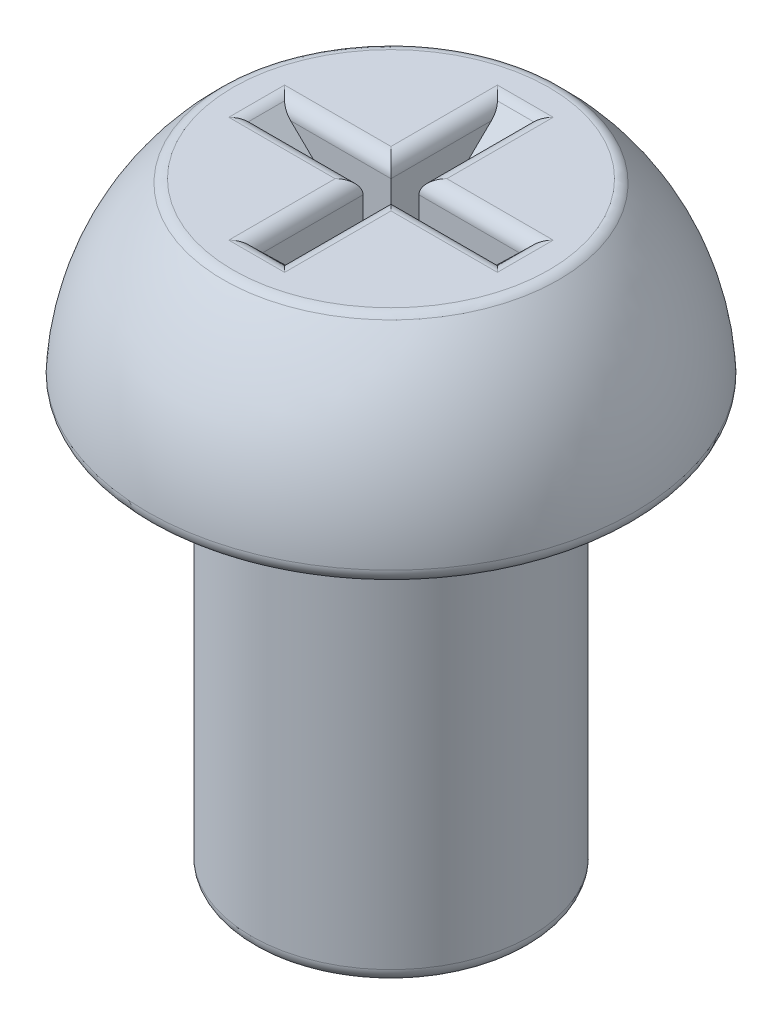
ISO-10303-21;
HEADER;
FILE_DESCRIPTION(('STEP AP214'),'2;1');
FILE_NAME('part.step','',(''),(''),'','','');
FILE_SCHEMA(('AUTOMOTIVE_DESIGN { 1 0 10303 214 1 1 1 1 }'));
ENDSEC;
DATA;
#1=APPLICATION_CONTEXT('core data for automotive mechanical design processes');
#2=APPLICATION_PROTOCOL_DEFINITION('international standard','automotive_design',2000,#1);
#3=PRODUCT_CONTEXT('',#1,'mechanical');
#4=PRODUCT('Part','Part','',(#3));
#5=PRODUCT_RELATED_PRODUCT_CATEGORY('part','',(#4));
#6=PRODUCT_DEFINITION_FORMATION('','',#4);
#7=PRODUCT_DEFINITION_CONTEXT('part definition',#1,'design');
#8=PRODUCT_DEFINITION('design','',#6,#7);
#9=PRODUCT_DEFINITION_SHAPE('','',#8);
#10=(LENGTH_UNIT() NAMED_UNIT(*) SI_UNIT(.MILLI.,.METRE.));
#11=(NAMED_UNIT(*) PLANE_ANGLE_UNIT() SI_UNIT($,.RADIAN.));
#12=(NAMED_UNIT(*) SI_UNIT($,.STERADIAN.) SOLID_ANGLE_UNIT());
#13=UNCERTAINTY_MEASURE_WITH_UNIT(LENGTH_MEASURE(1.E-05),#10,'distance_accuracy_value','');
#14=(GEOMETRIC_REPRESENTATION_CONTEXT(3) GLOBAL_UNCERTAINTY_ASSIGNED_CONTEXT((#13)) GLOBAL_UNIT_ASSIGNED_CONTEXT((#10,
#11,#12)) REPRESENTATION_CONTEXT('',''));
#15=CARTESIAN_POINT('',(0.,0.,0.));
#16=DIRECTION('',(0.,0.,1.));
#17=DIRECTION('',(1.,0.,0.));
#18=AXIS2_PLACEMENT_3D('',#15,#16,#17);
#19=CARTESIAN_POINT('',(0.,5.6,0.));
#20=DIRECTION('',(0.,1.,0.));
#21=DIRECTION('',(-1.,0.,0.));
#22=AXIS2_PLACEMENT_3D('',#19,#20,#21);
#23=PLANE('',#22);
#24=DIRECTION('',(-1.,0.,0.));
#25=VECTOR('',#24,1.);
#26=CARTESIAN_POINT('',(0.,5.6,-0.4));
#27=LINE('',#26,#25);
#28=CARTESIAN_POINT('',(-1.92436585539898,5.59999999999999,-0.4));
#29=VERTEX_POINT('',#28);
#30=CARTESIAN_POINT('',(-0.400000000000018,5.59999999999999,-0.4));
#31=VERTEX_POINT('',#30);
#32=EDGE_CURVE('E247',#29,#31,#27,.F.);
#33=ORIENTED_EDGE('',*,*,#32,.T.);
#34=DIRECTION('',(0.,0.,-1.));
#35=VECTOR('',#34,1.);
#36=CARTESIAN_POINT('',(-0.400000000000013,5.59999999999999,-1.84307490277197));
#37=LINE('',#36,#35);
#38=CARTESIAN_POINT('',(-0.400000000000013,5.59999999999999,-1.92436585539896));
#39=VERTEX_POINT('',#38);
#40=EDGE_CURVE('E249',#31,#39,#37,.T.);
#41=ORIENTED_EDGE('',*,*,#40,.T.);
#42=DIRECTION('',(-1.,0.,0.));
#43=VECTOR('',#42,1.);
#44=CARTESIAN_POINT('',(0.199999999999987,5.6,-1.92436585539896));
#45=LINE('',#44,#43);
#46=CARTESIAN_POINT('',(0.399999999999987,5.6,-1.92436585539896));
#47=VERTEX_POINT('',#46);
#48=EDGE_CURVE('E227',#39,#47,#45,.F.);
#49=ORIENTED_EDGE('',*,*,#48,.T.);
#50=DIRECTION('',(0.,0.,-1.));
#51=VECTOR('',#50,1.);
#52=CARTESIAN_POINT('',(0.39999999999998,5.6,0.));
#53=LINE('',#52,#51);
#54=CARTESIAN_POINT('',(0.399999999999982,5.6,-0.4));
#55=VERTEX_POINT('',#54);
#56=EDGE_CURVE('E229',#47,#55,#53,.F.);
#57=ORIENTED_EDGE('',*,*,#56,.T.);
#58=DIRECTION('',(-1.,0.,0.));
#59=VECTOR('',#58,1.);
#60=CARTESIAN_POINT('',(0.,5.6,-0.4));
#61=LINE('',#60,#59);
#62=CARTESIAN_POINT('',(1.92436585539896,5.6,-0.4));
#63=VERTEX_POINT('',#62);
#64=EDGE_CURVE('E231',#55,#63,#61,.F.);
#65=ORIENTED_EDGE('',*,*,#64,.T.);
#66=DIRECTION('',(0.,0.,1.));
#67=VECTOR('',#66,1.);
#68=CARTESIAN_POINT('',(1.92436585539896,5.6,0.2));
#69=LINE('',#68,#67);
#70=CARTESIAN_POINT('',(1.92436585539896,5.6,0.4));
#71=VERTEX_POINT('',#70);
#72=EDGE_CURVE('E233',#63,#71,#69,.T.);
#73=ORIENTED_EDGE('',*,*,#72,.T.);
#74=DIRECTION('',(-1.,0.,0.));
#75=VECTOR('',#74,1.);
#76=CARTESIAN_POINT('',(0.19999999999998,5.6,0.4));
#77=LINE('',#76,#75);
#78=CARTESIAN_POINT('',(0.399999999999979,5.6,0.4));
#79=VERTEX_POINT('',#78);
#80=EDGE_CURVE('E235',#71,#79,#77,.T.);
#81=ORIENTED_EDGE('',*,*,#80,.T.);
#82=DIRECTION('',(0.,0.,-1.));
#83=VECTOR('',#82,1.);
#84=CARTESIAN_POINT('',(0.39999999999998,5.6,0.));
#85=LINE('',#84,#83);
#86=CARTESIAN_POINT('',(0.399999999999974,5.6,1.92436585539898));
#87=VERTEX_POINT('',#86);
#88=EDGE_CURVE('E237',#79,#87,#85,.F.);
#89=ORIENTED_EDGE('',*,*,#88,.T.);
#90=DIRECTION('',(-1.,0.,0.));
#91=VECTOR('',#90,1.);
#92=CARTESIAN_POINT('',(-0.200000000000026,5.59999999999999,1.92436585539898));
#93=LINE('',#92,#91);
#94=CARTESIAN_POINT('',(-0.400000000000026,5.59999999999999,1.92436585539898));
#95=VERTEX_POINT('',#94);
#96=EDGE_CURVE('E239',#87,#95,#93,.T.);
#97=ORIENTED_EDGE('',*,*,#96,.T.);
#98=DIRECTION('',(0.,0.,-1.));
#99=VECTOR('',#98,1.);
#100=CARTESIAN_POINT('',(-0.40000000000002,5.59999999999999,0.199999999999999));
#101=LINE('',#100,#99);
#102=CARTESIAN_POINT('',(-0.400000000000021,5.59999999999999,0.4));
#103=VERTEX_POINT('',#102);
#104=EDGE_CURVE('E241',#95,#103,#101,.T.);
#105=ORIENTED_EDGE('',*,*,#104,.T.);
#106=DIRECTION('',(-1.,0.,0.));
#107=VECTOR('',#106,1.);
#108=CARTESIAN_POINT('',(-1.84307490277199,5.59999999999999,0.4));
#109=LINE('',#108,#107);
#110=CARTESIAN_POINT('',(-1.92436585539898,5.59999999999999,0.4));
#111=VERTEX_POINT('',#110);
#112=EDGE_CURVE('E243',#103,#111,#109,.T.);
#113=ORIENTED_EDGE('',*,*,#112,.T.);
#114=DIRECTION('',(0.,0.,1.));
#115=VECTOR('',#114,1.);
#116=CARTESIAN_POINT('',(-1.92436585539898,5.59999999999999,-0.2));
#117=LINE('',#116,#115);
#118=EDGE_CURVE('E245',#111,#29,#117,.F.);
#119=ORIENTED_EDGE('',*,*,#118,.T.);
#120=EDGE_LOOP('',(#33,#41,#49,#57,#65,#73,#81,#89,#97,#105,#113,#119));
#121=FACE_BOUND('',#120,.T.);
#122=CARTESIAN_POINT('',(0.,5.6,0.));
#123=DIRECTION('',(0.,1.,0.));
#124=DIRECTION('',(-1.,0.,0.));
#125=AXIS2_PLACEMENT_3D('',#122,#123,#124);
#126=CIRCLE('',#125,2.26495033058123);
#127=CARTESIAN_POINT('',(-2.26495033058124,5.59999999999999,0.));
#128=VERTEX_POINT('',#127);
#129=EDGE_CURVE('E224',#128,#128,#126,.T.);
#130=ORIENTED_EDGE('',*,*,#129,.T.);
#131=EDGE_LOOP('',(#130));
#132=FACE_BOUND('',#131,.T.);
#133=ADVANCED_FACE('F34',(#121,#132),#23,.T.);
#134=CARTESIAN_POINT('',(0.,0.,-0.2));
#135=DIRECTION('',(0.,0.,1.));
#136=DIRECTION('',(1.,0.,0.));
#137=AXIS2_PLACEMENT_3D('',#134,#135,#136);
#138=PLANE('',#137);
#139=DIRECTION('',(0.716435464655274,0.697653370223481,0.));
#140=VECTOR('',#139,1.);
#141=CARTESIAN_POINT('',(0.2,4.,-0.2));
#142=LINE('',#141,#140);
#143=CARTESIAN_POINT('',(0.199999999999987,4.00000000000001,-0.199999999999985));
#144=VERTEX_POINT('',#143);
#145=CARTESIAN_POINT('',(1.63769053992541,5.4,-0.2));
#146=VERTEX_POINT('',#145);
#147=EDGE_CURVE('E178',#144,#146,#142,.T.);
#148=ORIENTED_EDGE('',*,*,#147,.T.);
#149=DIRECTION('',(-1.,0.,0.));
#150=VECTOR('',#149,1.);
#151=CARTESIAN_POINT('',(0.,5.4,-0.2));
#152=LINE('',#151,#150);
#153=CARTESIAN_POINT('',(0.199999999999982,5.4,-0.2));
#154=VERTEX_POINT('',#153);
#155=EDGE_CURVE('E180',#146,#154,#152,.T.);
#156=ORIENTED_EDGE('',*,*,#155,.T.);
#157=DIRECTION('',(0.,-1.,0.));
#158=VECTOR('',#157,1.);
#159=CARTESIAN_POINT('',(0.200000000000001,0.,-0.2));
#160=LINE('',#159,#158);
#161=EDGE_CURVE('E164',#154,#144,#160,.T.);
#162=ORIENTED_EDGE('',*,*,#161,.T.);
#163=EDGE_LOOP('',(#148,#156,#162));
#164=FACE_BOUND('',#163,.T.);
#165=ADVANCED_FACE('F176',(#164),#138,.T.);
#166=CARTESIAN_POINT('',(0.,0.,0.2));
#167=DIRECTION('',(0.,0.,1.));
#168=DIRECTION('',(1.,0.,0.));
#169=AXIS2_PLACEMENT_3D('',#166,#167,#168);
#170=PLANE('',#169);
#171=DIRECTION('',(0.,-1.,0.));
#172=VECTOR('',#171,1.);
#173=CARTESIAN_POINT('',(0.199999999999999,0.,0.2));
#174=LINE('',#173,#172);
#175=CARTESIAN_POINT('',(0.19999999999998,5.4,0.2));
#176=VERTEX_POINT('',#175);
#177=CARTESIAN_POINT('',(0.199999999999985,4.,0.200000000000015));
#178=VERTEX_POINT('',#177);
#179=EDGE_CURVE('E222',#176,#178,#174,.T.);
#180=ORIENTED_EDGE('',*,*,#179,.F.);
#181=DIRECTION('',(-1.,0.,0.));
#182=VECTOR('',#181,1.);
#183=CARTESIAN_POINT('',(1.84307490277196,5.4,0.2));
#184=LINE('',#183,#182);
#185=CARTESIAN_POINT('',(1.63769053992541,5.4,0.2));
#186=VERTEX_POINT('',#185);
#187=EDGE_CURVE('E267',#176,#186,#184,.F.);
#188=ORIENTED_EDGE('',*,*,#187,.T.);
#189=DIRECTION('',(0.716435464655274,0.697653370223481,0.));
#190=VECTOR('',#189,1.);
#191=CARTESIAN_POINT('',(0.2,4.,0.2));
#192=LINE('',#191,#190);
#193=EDGE_CURVE('E216',#178,#186,#192,.T.);
#194=ORIENTED_EDGE('',*,*,#193,.F.);
#195=EDGE_LOOP('',(#180,#188,#194));
#196=FACE_BOUND('',#195,.T.);
#197=ADVANCED_FACE('F397',(#196),#170,.F.);
#198=CARTESIAN_POINT('',(0.,3.,0.));
#199=DIRECTION('',(0.,-1.,0.));
#200=DIRECTION('',(1.,0.,0.));
#201=AXIS2_PLACEMENT_3D('',#198,#199,#200);
#202=SPHERICAL_SURFACE('',#201,3.5);
#203=CARTESIAN_POINT('',(0.,5.54545454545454,0.));
#204=DIRECTION('',(0.,-1.,0.));
#205=DIRECTION('',(1.,0.,0.));
#206=AXIS2_PLACEMENT_3D('',#203,#204,#205);
#207=CIRCLE('',#206,2.40222004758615);
#208=CARTESIAN_POINT('',(2.40222004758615,5.54545454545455,0.));
#209=VERTEX_POINT('',#208);
#210=EDGE_CURVE('E276',#209,#209,#207,.T.);
#211=CARTESIAN_POINT('',(0.,3.2121212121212,0.));
#212=DIRECTION('',(0.,-1.,0.));
#213=DIRECTION('',(1.,0.,0.));
#214=AXIS2_PLACEMENT_3D('',#211,#212,#213);
#215=CIRCLE('',#214,3.49356617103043);
#216=CARTESIAN_POINT('',(3.49356617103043,3.21212121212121,0.));
#217=VERTEX_POINT('',#216);
#218=EDGE_CURVE('E273',#217,#217,#215,.F.);
#219=CARTESIAN_POINT('',(2.40222004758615,5.54545454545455,0.));
#220=CARTESIAN_POINT('',(2.42220447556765,5.52659474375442,0.));
#221=CARTESIAN_POINT('',(2.44196671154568,5.50749950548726,0.));
#222=CARTESIAN_POINT('',(2.48103603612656,5.46884894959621,0.));
#223=CARTESIAN_POINT('',(2.5003431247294,5.44929363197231,0.));
#224=CARTESIAN_POINT('',(2.53849139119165,5.40973371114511,0.));
#225=CARTESIAN_POINT('',(2.55733256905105,5.3897291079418,0.));
#226=CARTESIAN_POINT('',(2.59453857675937,5.34928172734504,0.));
#227=CARTESIAN_POINT('',(2.61290340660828,5.3288389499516,0.));
#228=CARTESIAN_POINT('',(2.64914652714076,5.2875265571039,0.));
#229=CARTESIAN_POINT('',(2.66702481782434,5.26665694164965,0.));
#230=CARTESIAN_POINT('',(2.7022849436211,5.22450245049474,0.));
#231=CARTESIAN_POINT('',(2.7196667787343,5.20321757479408,0.));
#232=CARTESIAN_POINT('',(2.75392435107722,5.16024436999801,0.));
#233=CARTESIAN_POINT('',(2.77080008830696,5.1385560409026,0.));
#234=CARTESIAN_POINT('',(2.80403610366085,5.09478796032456,0.));
#235=CARTESIAN_POINT('',(2.820396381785,5.07270820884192,0.));
#236=CARTESIAN_POINT('',(2.85259240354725,5.02816953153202,0.));
#237=CARTESIAN_POINT('',(2.86842814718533,5.00571060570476,0.));
#238=CARTESIAN_POINT('',(2.89956631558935,4.96042603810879,0.));
#239=CARTESIAN_POINT('',(2.91486874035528,4.93760039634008,0.));
#240=CARTESIAN_POINT('',(2.94493178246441,4.89159505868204,0.));
#241=CARTESIAN_POINT('',(2.95969239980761,4.86841536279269,0.));
#242=CARTESIAN_POINT('',(2.98866363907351,4.82171477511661,0.));
#243=CARTESIAN_POINT('',(3.0028742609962,4.79819388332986,0.));
#244=CARTESIAN_POINT('',(3.03073762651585,4.75082395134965,0.));
#245=CARTESIAN_POINT('',(3.04439037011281,4.72697491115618,0.));
#246=CARTESIAN_POINT('',(3.07113040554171,4.67896191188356,0.));
#247=CARTESIAN_POINT('',(3.08421769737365,4.6547979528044,0.));
#248=CARTESIAN_POINT('',(3.1098195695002,4.60616851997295,0.));
#249=CARTESIAN_POINT('',(3.12233414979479,4.58170304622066,0.));
#250=CARTESIAN_POINT('',(3.14678365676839,4.53248415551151,0.));
#251=CARTESIAN_POINT('',(3.1587185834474,4.50773073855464,0.));
#252=CARTESIAN_POINT('',(3.1820021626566,4.45794969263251,0.));
#253=CARTESIAN_POINT('',(3.19335081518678,4.43292206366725,0.));
#254=CARTESIAN_POINT('',(3.21545555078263,4.38260647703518,0.));
#255=CARTESIAN_POINT('',(3.2262116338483,4.35731851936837,0.));
#256=CARTESIAN_POINT('',(3.2471252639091,4.3064963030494,0.));
#257=CARTESIAN_POINT('',(3.25728281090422,4.28096204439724,0.));
#258=CARTESIAN_POINT('',(3.27699373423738,4.22966139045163,0.));
#259=CARTESIAN_POINT('',(3.28654711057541,4.20389499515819,0.));
#260=CARTESIAN_POINT('',(3.30504439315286,4.15214436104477,0.));
#261=CARTESIAN_POINT('',(3.31398829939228,4.12616012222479,0.));
#262=CARTESIAN_POINT('',(3.33126168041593,4.07398821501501,0.));
#263=CARTESIAN_POINT('',(3.33959115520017,4.04780054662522,0.));
#264=CARTESIAN_POINT('',(3.35563105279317,3.99523630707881,0.));
#265=CARTESIAN_POINT('',(3.36334147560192,3.96885973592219,0.));
#266=CARTESIAN_POINT('',(3.37813899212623,3.9159323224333,0.));
#267=CARTESIAN_POINT('',(3.38522608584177,3.88938148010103,0.));
#268=CARTESIAN_POINT('',(3.39877301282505,3.8361202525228,0.));
#269=CARTESIAN_POINT('',(3.40523284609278,3.80940986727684,0.));
#270=CARTESIAN_POINT('',(3.41752166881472,3.75584437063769,0.));
#271=CARTESIAN_POINT('',(3.42335065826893,3.7289892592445,0.));
#272=CARTESIAN_POINT('',(3.43437455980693,3.67514920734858,0.));
#273=CARTESIAN_POINT('',(3.43956947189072,3.64816426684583,0.));
#274=CARTESIAN_POINT('',(3.44932233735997,3.59407952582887,0.));
#275=CARTESIAN_POINT('',(3.45388029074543,3.56697972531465,0.));
#276=CARTESIAN_POINT('',(3.46235670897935,3.51268029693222,0.));
#277=CARTESIAN_POINT('',(3.46627517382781,3.48548066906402,0.));
#278=CARTESIAN_POINT('',(3.47347044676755,3.43099667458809,0.));
#279=CARTESIAN_POINT('',(3.47674725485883,3.40371230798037,0.));
#280=CARTESIAN_POINT('',(3.48265737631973,3.34907396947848,0.));
#281=CARTESIAN_POINT('',(3.48529068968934,3.32171999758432,0.));
#282=CARTESIAN_POINT('',(3.48991243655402,3.26695762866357,0.));
#283=CARTESIAN_POINT('',(3.49190087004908,3.23954923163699,0.));
#284=CARTESIAN_POINT('',(3.49356617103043,3.21212121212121,0.));
#285=B_SPLINE_CURVE_WITH_KNOTS('',3,(#219,#220,#221,#222,#223,#224,#225,#226,#227,#228,#229,
#230,#231,#232,#233,#234,#235,#236,#237,#238,#239,#240,#241,#242,#243,#244,#245,#246,#247,#248,
#249,#250,#251,#252,#253,#254,#255,#256,#257,#258,#259,#260,#261,#262,#263,#264,#265,#266,#267,
#268,#269,#270,#271,#272,#273,#274,#275,#276,#277,#278,#279,#280,#281,#282,#283,#284),
.UNSPECIFIED.,.F.,.F.,(4,2,2,2,2,2,2,2,2,2,2,2,2,2,2,2,2,2,2,2,2,2,2,2,2,2,2,2,2,2,2,2,4),(0.,
0.0824336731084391,0.164867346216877,0.247301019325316,0.329734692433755,0.412168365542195,
0.494602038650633,0.577035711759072,0.659469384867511,0.741903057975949,0.824336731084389,
0.906770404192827,0.989204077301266,1.0716377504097,1.15407142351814,1.23650509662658,
1.31893876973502,1.40137244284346,1.4838061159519,1.56623978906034,1.64867346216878,
1.73110713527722,1.81354080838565,1.89597448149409,1.97840815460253,2.06084182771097,
2.14327550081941,2.22570917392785,2.30814284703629,2.39057652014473,2.47301019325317,
2.5554438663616,2.63787753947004),.UNSPECIFIED.);
#286=EDGE_CURVE('BSEAM438',#209,#217,#285,.T.);
#287=ORIENTED_EDGE('',*,*,#210,.T.);
#288=ORIENTED_EDGE('',*,*,#218,.T.);
#289=ORIENTED_EDGE('',*,*,#286,.T.);
#290=ORIENTED_EDGE('',*,*,#286,.F.);
#291=EDGE_LOOP('',(#287,#289,#288,#290));
#292=FACE_BOUND('',#291,.T.);
#293=ADVANCED_FACE('F438',(#292),#202,.T.);
#294=CARTESIAN_POINT('',(1.99999999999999,3.,0.));
#295=DIRECTION('',(0.,-1.,0.));
#296=DIRECTION('',(1.,0.,0.));
#297=AXIS2_PLACEMENT_3D('',#294,#295,#296);
#298=PLANE('',#297);
#299=CARTESIAN_POINT('',(0.,2.99999999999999,0.));
#300=DIRECTION('',(0.,-1.,0.));
#301=DIRECTION('',(1.,0.,0.));
#302=AXIS2_PLACEMENT_3D('',#299,#300,#301);
#303=CIRCLE('',#302,3.29393381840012);
#304=CARTESIAN_POINT('',(3.29393381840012,3.,0.));
#305=VERTEX_POINT('',#304);
#306=EDGE_CURVE('E279',#305,#305,#303,.T.);
#307=ORIENTED_EDGE('',*,*,#306,.T.);
#308=EDGE_LOOP('',(#307));
#309=FACE_BOUND('',#308,.T.);
#310=CARTESIAN_POINT('',(0.,3.,0.));
#311=DIRECTION('',(0.,-1.,0.));
#312=DIRECTION('',(1.,0.,0.));
#313=AXIS2_PLACEMENT_3D('',#310,#311,#312);
#314=CIRCLE('',#313,2.);
#315=CARTESIAN_POINT('',(1.99999999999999,3.00000000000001,0.));
#316=VERTEX_POINT('',#315);
#317=EDGE_CURVE('E204',#316,#316,#314,.T.);
#318=ORIENTED_EDGE('',*,*,#317,.F.);
#319=EDGE_LOOP('',(#318));
#320=FACE_BOUND('',#319,.T.);
#321=ADVANCED_FACE('F476',(#309,#320),#298,.T.);
#322=CARTESIAN_POINT('',(2.42576704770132E-12,-694.767295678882,0.));
#323=DIRECTION('',(0.,-1.,0.));
#324=DIRECTION('',(1.,0.,0.));
#325=AXIS2_PLACEMENT_3D('',#322,#323,#324);
#326=CYLINDRICAL_SURFACE('',#325,1.99999999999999);
#327=CARTESIAN_POINT('',(0.,-2.80000000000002,0.));
#328=DIRECTION('',(0.,-1.,0.));
#329=DIRECTION('',(1.,0.,0.));
#330=AXIS2_PLACEMENT_3D('',#327,#328,#329);
#331=CIRCLE('',#330,1.99999999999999);
#332=CARTESIAN_POINT('',(2.,-2.80000000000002,0.));
#333=VERTEX_POINT('',#332);
#334=EDGE_CURVE('E285',#333,#333,#331,.F.);
#335=ORIENTED_EDGE('',*,*,#334,.T.);
#336=EDGE_LOOP('',(#335));
#337=FACE_BOUND('',#336,.T.);
#338=ORIENTED_EDGE('',*,*,#317,.T.);
#339=EDGE_LOOP('',(#338));
#340=FACE_BOUND('',#339,.T.);
#341=ADVANCED_FACE('F479',(#337,#340),#326,.T.);
#342=CARTESIAN_POINT('',(0.,-3.,0.));
#343=DIRECTION('',(0.,-1.,0.));
#344=DIRECTION('',(1.,0.,0.));
#345=AXIS2_PLACEMENT_3D('',#342,#343,#344);
#346=PLANE('',#345);
#347=CARTESIAN_POINT('',(0.,-3.,0.));
#348=DIRECTION('',(0.,-1.,0.));
#349=DIRECTION('',(1.,0.,0.));
#350=AXIS2_PLACEMENT_3D('',#347,#348,#349);
#351=CIRCLE('',#350,1.79999999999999);
#352=CARTESIAN_POINT('',(1.8,-3.,0.));
#353=VERTEX_POINT('',#352);
#354=EDGE_CURVE('E282',#353,#353,#351,.T.);
#355=ORIENTED_EDGE('',*,*,#354,.T.);
#356=EDGE_LOOP('',(#355));
#357=FACE_BOUND('',#356,.T.);
#358=ADVANCED_FACE('F483',(#357),#346,.T.);
#359=CARTESIAN_POINT('',(-1.84307490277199,5.60000000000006,-0.2));
#360=DIRECTION('',(-0.697653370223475,-0.71643546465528,0.));
#361=DIRECTION('',(0.71643546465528,-0.697653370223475,0.));
#362=AXIS2_PLACEMENT_3D('',#359,#360,#361);
#363=PLANE('',#362);
#364=CARTESIAN_POINT('',(-1.63769053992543,5.39999999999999,-0.4));
#365=DIRECTION('',(-0.697653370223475,-0.71643546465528,0.));
#366=DIRECTION('',(-0.71643546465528,0.697653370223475,0.));
#367=AXIS2_PLACEMENT_3D('',#364,#365,#366);
#368=ELLIPSE('',#367,0.286675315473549,0.2);
#369=CARTESIAN_POINT('',(-1.63769053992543,5.39999999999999,-0.2));
#370=VERTEX_POINT('',#369);
#371=CARTESIAN_POINT('',(-1.78483518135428,5.54328709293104,-0.260469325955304));
#372=VERTEX_POINT('',#371);
#373=EDGE_CURVE('E290',#370,#372,#368,.T.);
#374=ORIENTED_EDGE('',*,*,#373,.T.);
#375=DIRECTION('',(0.,0.,1.));
#376=VECTOR('',#375,1.);
#377=CARTESIAN_POINT('',(-1.78483518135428,5.54328709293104,0.2));
#378=LINE('',#377,#376);
#379=CARTESIAN_POINT('',(-1.78483518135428,5.54328709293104,0.260469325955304));
#380=VERTEX_POINT('',#379);
#381=EDGE_CURVE('E257',#372,#380,#378,.T.);
#382=ORIENTED_EDGE('',*,*,#381,.T.);
#383=CARTESIAN_POINT('',(-1.63769053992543,5.39999999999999,0.4));
#384=DIRECTION('',(-0.697653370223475,-0.71643546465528,0.));
#385=DIRECTION('',(0.71643546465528,-0.697653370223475,0.));
#386=AXIS2_PLACEMENT_3D('',#383,#384,#385);
#387=ELLIPSE('',#386,0.286675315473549,0.2);
#388=CARTESIAN_POINT('',(-1.63769053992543,5.39999999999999,0.2));
#389=VERTEX_POINT('',#388);
#390=EDGE_CURVE('E293',#380,#389,#387,.T.);
#391=ORIENTED_EDGE('',*,*,#390,.T.);
#392=DIRECTION('',(0.71643546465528,-0.697653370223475,0.));
#393=VECTOR('',#392,1.);
#394=CARTESIAN_POINT('',(-1.84307490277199,5.60000000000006,0.2));
#395=LINE('',#394,#393);
#396=CARTESIAN_POINT('',(-0.2,4.,0.2));
#397=VERTEX_POINT('',#396);
#398=EDGE_CURVE('E181',#389,#397,#395,.T.);
#399=ORIENTED_EDGE('',*,*,#398,.T.);
#400=DIRECTION('',(0.,0.,1.));
#401=VECTOR('',#400,1.);
#402=CARTESIAN_POINT('',(-0.2,4.,-0.2));
#403=LINE('',#402,#401);
#404=CARTESIAN_POINT('',(-0.200000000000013,4.,-0.199999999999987));
#405=VERTEX_POINT('',#404);
#406=EDGE_CURVE('E205',#405,#397,#403,.T.);
#407=ORIENTED_EDGE('',*,*,#406,.F.);
#408=DIRECTION('',(0.71643546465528,-0.697653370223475,0.));
#409=VECTOR('',#408,1.);
#410=CARTESIAN_POINT('',(-1.84307490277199,5.60000000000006,-0.2));
#411=LINE('',#410,#409);
#412=EDGE_CURVE('E194',#370,#405,#411,.T.);
#413=ORIENTED_EDGE('',*,*,#412,.F.);
#414=EDGE_LOOP('',(#374,#382,#391,#399,#407,#413));
#415=FACE_BOUND('',#414,.T.);
#416=ADVANCED_FACE('F352',(#415),#363,.F.);
#417=CARTESIAN_POINT('',(0.2,4.,-0.2));
#418=DIRECTION('',(0.697653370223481,-0.716435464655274,0.));
#419=DIRECTION('',(0.716435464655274,0.697653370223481,0.));
#420=AXIS2_PLACEMENT_3D('',#417,#418,#419);
#421=PLANE('',#420);
#422=CARTESIAN_POINT('',(1.63769053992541,5.4,0.4));
#423=DIRECTION('',(0.697653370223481,-0.716435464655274,0.));
#424=DIRECTION('',(0.716435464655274,0.697653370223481,0.));
#425=AXIS2_PLACEMENT_3D('',#422,#423,#424);
#426=ELLIPSE('',#425,0.286675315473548,0.2);
#427=CARTESIAN_POINT('',(1.78483518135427,5.54328709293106,0.260469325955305));
#428=VERTEX_POINT('',#427);
#429=EDGE_CURVE('E300',#186,#428,#426,.T.);
#430=ORIENTED_EDGE('',*,*,#429,.T.);
#431=DIRECTION('',(0.,0.,1.));
#432=VECTOR('',#431,1.);
#433=CARTESIAN_POINT('',(1.78483518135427,5.54328709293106,-0.2));
#434=LINE('',#433,#432);
#435=CARTESIAN_POINT('',(1.78483518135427,5.54328709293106,-0.260469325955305));
#436=VERTEX_POINT('',#435);
#437=EDGE_CURVE('E58',#428,#436,#434,.F.);
#438=ORIENTED_EDGE('',*,*,#437,.T.);
#439=CARTESIAN_POINT('',(1.63769053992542,5.4,-0.4));
#440=DIRECTION('',(0.697653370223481,-0.716435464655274,0.));
#441=DIRECTION('',(-0.716435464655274,-0.697653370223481,0.));
#442=AXIS2_PLACEMENT_3D('',#439,#440,#441);
#443=ELLIPSE('',#442,0.286675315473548,0.2);
#444=EDGE_CURVE('E43',#436,#146,#443,.T.);
#445=ORIENTED_EDGE('',*,*,#444,.T.);
#446=ORIENTED_EDGE('',*,*,#147,.F.);
#447=DIRECTION('',(0.,0.,1.));
#448=VECTOR('',#447,1.);
#449=CARTESIAN_POINT('',(0.2,4.,-0.2));
#450=LINE('',#449,#448);
#451=EDGE_CURVE('E198',#144,#178,#450,.T.);
#452=ORIENTED_EDGE('',*,*,#451,.T.);
#453=ORIENTED_EDGE('',*,*,#193,.T.);
#454=EDGE_LOOP('',(#430,#438,#445,#446,#452,#453));
#455=FACE_BOUND('',#454,.T.);
#456=ADVANCED_FACE('F207',(#455),#421,.F.);
#457=CARTESIAN_POINT('',(-0.2,4.,-0.2));
#458=DIRECTION('',(0.,-1.,0.));
#459=DIRECTION('',(0.,0.,-1.));
#460=AXIS2_PLACEMENT_3D('',#457,#458,#459);
#461=PLANE('',#460);
#462=DIRECTION('',(1.,0.,0.));
#463=VECTOR('',#462,1.);
#464=CARTESIAN_POINT('',(-0.2,4.,0.2));
#465=LINE('',#464,#463);
#466=EDGE_CURVE('E201',#397,#178,#465,.T.);
#467=ORIENTED_EDGE('',*,*,#466,.T.);
#468=ORIENTED_EDGE('',*,*,#451,.F.);
#469=DIRECTION('',(1.,0.,0.));
#470=VECTOR('',#469,1.);
#471=CARTESIAN_POINT('',(-0.2,4.,-0.2));
#472=LINE('',#471,#470);
#473=EDGE_CURVE('E186',#405,#144,#472,.T.);
#474=ORIENTED_EDGE('',*,*,#473,.F.);
#475=ORIENTED_EDGE('',*,*,#406,.T.);
#476=EDGE_LOOP('',(#467,#468,#474,#475));
#477=FACE_BOUND('',#476,.T.);
#478=ADVANCED_FACE('F199',(#477),#461,.F.);
#479=DIRECTION('',(0.,-1.,0.));
#480=VECTOR('',#479,1.);
#481=CARTESIAN_POINT('',(-0.199999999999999,0.,-0.2));
#482=LINE('',#481,#480);
#483=CARTESIAN_POINT('',(-0.200000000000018,5.4,-0.2));
#484=VERTEX_POINT('',#483);
#485=EDGE_CURVE('E182',#484,#405,#482,.T.);
#486=ORIENTED_EDGE('',*,*,#485,.F.);
#487=DIRECTION('',(-1.,0.,0.));
#488=VECTOR('',#487,1.);
#489=CARTESIAN_POINT('',(0.,5.4,-0.2));
#490=LINE('',#489,#488);
#491=EDGE_CURVE('E255',#484,#370,#490,.T.);
#492=ORIENTED_EDGE('',*,*,#491,.T.);
#493=ORIENTED_EDGE('',*,*,#412,.T.);
#494=EDGE_LOOP('',(#486,#492,#493));
#495=FACE_BOUND('',#494,.T.);
#496=ADVANCED_FACE('F347',(#495),#138,.T.);
#497=ORIENTED_EDGE('',*,*,#398,.F.);
#498=DIRECTION('',(-1.,0.,0.));
#499=VECTOR('',#498,1.);
#500=CARTESIAN_POINT('',(-0.20000000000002,5.4,0.2));
#501=LINE('',#500,#499);
#502=CARTESIAN_POINT('',(-0.20000000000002,5.4,0.2));
#503=VERTEX_POINT('',#502);
#504=EDGE_CURVE('E259',#389,#503,#501,.F.);
#505=ORIENTED_EDGE('',*,*,#504,.T.);
#506=DIRECTION('',(0.,-1.,0.));
#507=VECTOR('',#506,1.);
#508=CARTESIAN_POINT('',(-0.200000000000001,0.,0.2));
#509=LINE('',#508,#507);
#510=EDGE_CURVE('E220',#503,#397,#509,.T.);
#511=ORIENTED_EDGE('',*,*,#510,.T.);
#512=EDGE_LOOP('',(#497,#505,#511));
#513=FACE_BOUND('',#512,.T.);
#514=ADVANCED_FACE('F371',(#513),#170,.F.);
#515=CARTESIAN_POINT('',(0.2,0.,0.));
#516=DIRECTION('',(-1.,0.,0.));
#517=DIRECTION('',(0.,0.,1.));
#518=AXIS2_PLACEMENT_3D('',#515,#516,#517);
#519=PLANE('',#518);
#520=DIRECTION('',(0.,0.697653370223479,0.716435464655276));
#521=VECTOR('',#520,1.);
#522=CARTESIAN_POINT('',(0.199999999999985,4.,0.200000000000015));
#523=LINE('',#522,#521);
#524=CARTESIAN_POINT('',(0.199999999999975,5.4,1.63769053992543));
#525=VERTEX_POINT('',#524);
#526=EDGE_CURVE('E171',#178,#525,#523,.T.);
#527=ORIENTED_EDGE('',*,*,#526,.T.);
#528=DIRECTION('',(0.,0.,-1.));
#529=VECTOR('',#528,1.);
#530=CARTESIAN_POINT('',(0.199999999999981,5.4,0.));
#531=LINE('',#530,#529);
#532=EDGE_CURVE('E265',#525,#176,#531,.T.);
#533=ORIENTED_EDGE('',*,*,#532,.T.);
#534=ORIENTED_EDGE('',*,*,#179,.T.);
#535=EDGE_LOOP('',(#527,#533,#534));
#536=FACE_BOUND('',#535,.T.);
#537=ADVANCED_FACE('F388',(#536),#519,.T.);
#538=CARTESIAN_POINT('',(-0.2,0.,0.));
#539=DIRECTION('',(-1.,0.,0.));
#540=DIRECTION('',(0.,0.,1.));
#541=AXIS2_PLACEMENT_3D('',#538,#539,#540);
#542=PLANE('',#541);
#543=ORIENTED_EDGE('',*,*,#510,.F.);
#544=DIRECTION('',(0.,0.,-1.));
#545=VECTOR('',#544,1.);
#546=CARTESIAN_POINT('',(-0.200000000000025,5.4,1.84307490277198));
#547=LINE('',#546,#545);
#548=CARTESIAN_POINT('',(-0.200000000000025,5.4,1.63769053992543));
#549=VERTEX_POINT('',#548);
#550=EDGE_CURVE('E261',#503,#549,#547,.F.);
#551=ORIENTED_EDGE('',*,*,#550,.T.);
#552=DIRECTION('',(0.,0.697653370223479,0.716435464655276));
#553=VECTOR('',#552,1.);
#554=CARTESIAN_POINT('',(-0.200000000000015,4.,0.200000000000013));
#555=LINE('',#554,#553);
#556=EDGE_CURVE('E172',#397,#549,#555,.T.);
#557=ORIENTED_EDGE('',*,*,#556,.F.);
#558=EDGE_LOOP('',(#543,#551,#557));
#559=FACE_BOUND('',#558,.T.);
#560=ADVANCED_FACE('F375',(#559),#542,.F.);
#561=CARTESIAN_POINT('',(0.199999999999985,4.,0.200000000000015));
#562=DIRECTION('',(0.,-0.716435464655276,0.697653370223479));
#563=DIRECTION('',(0.,-0.697653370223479,-0.716435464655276));
#564=AXIS2_PLACEMENT_3D('',#561,#562,#563);
#565=PLANE('',#564);
#566=CARTESIAN_POINT('',(-0.400000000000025,5.39999999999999,1.63769053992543));
#567=DIRECTION('',(0.,-0.716435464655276,0.697653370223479));
#568=DIRECTION('',(0.,0.697653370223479,0.716435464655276));
#569=AXIS2_PLACEMENT_3D('',#566,#567,#568);
#570=ELLIPSE('',#569,0.286675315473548,0.2);
#571=CARTESIAN_POINT('',(-0.26046932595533,5.54328709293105,1.78483518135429));
#572=VERTEX_POINT('',#571);
#573=EDGE_CURVE('E295',#549,#572,#570,.T.);
#574=ORIENTED_EDGE('',*,*,#573,.T.);
#575=DIRECTION('',(-1.,0.,0.));
#576=VECTOR('',#575,1.);
#577=CARTESIAN_POINT('',(0.199999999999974,5.54328709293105,1.78483518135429));
#578=LINE('',#577,#576);
#579=CARTESIAN_POINT('',(0.260469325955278,5.54328709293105,1.78483518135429));
#580=VERTEX_POINT('',#579);
#581=EDGE_CURVE('E263',#572,#580,#578,.F.);
#582=ORIENTED_EDGE('',*,*,#581,.T.);
#583=CARTESIAN_POINT('',(0.399999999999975,5.4,1.63769053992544));
#584=DIRECTION('',(0.,-0.716435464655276,0.697653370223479));
#585=DIRECTION('',(0.,-0.697653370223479,-0.716435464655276));
#586=AXIS2_PLACEMENT_3D('',#583,#584,#585);
#587=ELLIPSE('',#586,0.286675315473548,0.2);
#588=EDGE_CURVE('E298',#580,#525,#587,.T.);
#589=ORIENTED_EDGE('',*,*,#588,.T.);
#590=ORIENTED_EDGE('',*,*,#526,.F.);
#591=ORIENTED_EDGE('',*,*,#466,.F.);
#592=ORIENTED_EDGE('',*,*,#556,.T.);
#593=EDGE_LOOP('',(#574,#582,#589,#590,#591,#592));
#594=FACE_BOUND('',#593,.T.);
#595=ADVANCED_FACE('F382',(#594),#565,.F.);
#596=CARTESIAN_POINT('',(0.199999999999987,5.60000000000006,-1.84307490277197));
#597=DIRECTION('',(0.,-0.716435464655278,-0.697653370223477));
#598=DIRECTION('',(0.,0.697653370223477,-0.716435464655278));
#599=AXIS2_PLACEMENT_3D('',#596,#597,#598);
#600=PLANE('',#599);
#601=CARTESIAN_POINT('',(0.399999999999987,5.4,-1.63769053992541));
#602=DIRECTION('',(0.,-0.716435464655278,-0.697653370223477));
#603=DIRECTION('',(0.,0.697653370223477,-0.716435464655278));
#604=AXIS2_PLACEMENT_3D('',#601,#602,#603);
#605=ELLIPSE('',#604,0.286675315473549,0.2);
#606=CARTESIAN_POINT('',(0.199999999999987,5.4,-1.63769053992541));
#607=VERTEX_POINT('',#606);
#608=CARTESIAN_POINT('',(0.260469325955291,5.54328709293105,-1.78483518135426));
#609=VERTEX_POINT('',#608);
#610=EDGE_CURVE('E11',#607,#609,#605,.T.);
#611=ORIENTED_EDGE('',*,*,#610,.T.);
#612=DIRECTION('',(-1.,0.,0.));
#613=VECTOR('',#612,1.);
#614=CARTESIAN_POINT('',(-0.200000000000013,5.54328709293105,-1.78483518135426));
#615=LINE('',#614,#613);
#616=CARTESIAN_POINT('',(-0.260469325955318,5.54328709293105,-1.78483518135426));
#617=VERTEX_POINT('',#616);
#618=EDGE_CURVE('E51',#609,#617,#615,.T.);
#619=ORIENTED_EDGE('',*,*,#618,.T.);
#620=CARTESIAN_POINT('',(-0.400000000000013,5.39999999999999,-1.63769053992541));
#621=DIRECTION('',(0.,-0.716435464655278,-0.697653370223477));
#622=DIRECTION('',(0.,-0.697653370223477,0.716435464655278));
#623=AXIS2_PLACEMENT_3D('',#620,#621,#622);
#624=ELLIPSE('',#623,0.286675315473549,0.2);
#625=CARTESIAN_POINT('',(-0.200000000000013,5.4,-1.63769053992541));
#626=VERTEX_POINT('',#625);
#627=EDGE_CURVE('E288',#617,#626,#624,.T.);
#628=ORIENTED_EDGE('',*,*,#627,.T.);
#629=DIRECTION('',(0.,-0.697653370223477,0.716435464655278));
#630=VECTOR('',#629,1.);
#631=CARTESIAN_POINT('',(-0.200000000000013,5.60000000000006,-1.84307490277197));
#632=LINE('',#631,#630);
#633=EDGE_CURVE('E190',#626,#405,#632,.T.);
#634=ORIENTED_EDGE('',*,*,#633,.T.);
#635=ORIENTED_EDGE('',*,*,#473,.T.);
#636=DIRECTION('',(0.,-0.697653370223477,0.716435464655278));
#637=VECTOR('',#636,1.);
#638=CARTESIAN_POINT('',(0.199999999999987,5.60000000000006,-1.84307490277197));
#639=LINE('',#638,#637);
#640=EDGE_CURVE('E161',#607,#144,#639,.T.);
#641=ORIENTED_EDGE('',*,*,#640,.F.);
#642=EDGE_LOOP('',(#611,#619,#628,#634,#635,#641));
#643=FACE_BOUND('',#642,.T.);
#644=ADVANCED_FACE('F188',(#643),#600,.F.);
#645=ORIENTED_EDGE('',*,*,#161,.F.);
#646=DIRECTION('',(0.,0.,-1.));
#647=VECTOR('',#646,1.);
#648=CARTESIAN_POINT('',(0.199999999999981,5.4,0.));
#649=LINE('',#648,#647);
#650=EDGE_CURVE('E167',#154,#607,#649,.T.);
#651=ORIENTED_EDGE('',*,*,#650,.T.);
#652=ORIENTED_EDGE('',*,*,#640,.T.);
#653=EDGE_LOOP('',(#645,#651,#652));
#654=FACE_BOUND('',#653,.T.);
#655=ADVANCED_FACE('F163',(#654),#519,.T.);
#656=ORIENTED_EDGE('',*,*,#633,.F.);
#657=DIRECTION('',(0.,0.,-1.));
#658=VECTOR('',#657,1.);
#659=CARTESIAN_POINT('',(-0.200000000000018,5.4,-0.2));
#660=LINE('',#659,#658);
#661=EDGE_CURVE('E252',#626,#484,#660,.F.);
#662=ORIENTED_EDGE('',*,*,#661,.T.);
#663=ORIENTED_EDGE('',*,*,#485,.T.);
#664=EDGE_LOOP('',(#656,#662,#663));
#665=FACE_BOUND('',#664,.T.);
#666=ADVANCED_FACE('F416',(#665),#542,.F.);
#667=CARTESIAN_POINT('',(0.399999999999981,5.4,0.));
#668=DIRECTION('',(0.,0.,-1.));
#669=DIRECTION('',(-1.,0.,0.));
#670=AXIS2_PLACEMENT_3D('',#667,#668,#669);
#671=CYLINDRICAL_SURFACE('',#670,0.2);
#672=ORIENTED_EDGE('',*,*,#532,.F.);
#673=ORIENTED_EDGE('',*,*,#588,.F.);
#674=CARTESIAN_POINT('',(0.399999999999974,5.4,1.92436585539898));
#675=DIRECTION('',(0.70710678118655,0.,-0.707106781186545));
#676=DIRECTION('',(0.707106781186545,0.,0.70710678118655));
#677=AXIS2_PLACEMENT_3D('',#674,#675,#676);
#678=ELLIPSE('',#677,0.282842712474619,0.2);
#679=EDGE_CURVE('E38',#87,#580,#678,.F.);
#680=ORIENTED_EDGE('',*,*,#679,.F.);
#681=ORIENTED_EDGE('',*,*,#88,.F.);
#682=CARTESIAN_POINT('',(0.39999999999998,5.4,0.4));
#683=DIRECTION('',(0.707106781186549,0.,-0.707106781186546));
#684=DIRECTION('',(0.707106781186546,0.,0.707106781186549));
#685=AXIS2_PLACEMENT_3D('',#682,#683,#684);
#686=ELLIPSE('',#685,0.282842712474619,0.2);
#687=EDGE_CURVE('E329',#176,#79,#686,.T.);
#688=ORIENTED_EDGE('',*,*,#687,.F.);
#689=EDGE_LOOP('',(#672,#673,#680,#681,#688));
#690=FACE_BOUND('',#689,.T.);
#691=ADVANCED_FACE('F391',(#690),#671,.T.);
#692=CARTESIAN_POINT('',(0.,5.4,1.92436585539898));
#693=DIRECTION('',(1.,0.,0.));
#694=DIRECTION('',(0.,1.,0.));
#695=AXIS2_PLACEMENT_3D('',#692,#693,#694);
#696=CYLINDRICAL_SURFACE('',#695,0.2);
#697=ORIENTED_EDGE('',*,*,#581,.F.);
#698=CARTESIAN_POINT('',(-0.400000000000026,5.39999999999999,1.92436585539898));
#699=DIRECTION('',(0.707106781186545,0.,0.70710678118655));
#700=DIRECTION('',(-0.70710678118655,0.,0.707106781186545));
#701=AXIS2_PLACEMENT_3D('',#698,#699,#700);
#702=ELLIPSE('',#701,0.282842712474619,0.2);
#703=EDGE_CURVE('E327',#95,#572,#702,.F.);
#704=ORIENTED_EDGE('',*,*,#703,.F.);
#705=ORIENTED_EDGE('',*,*,#96,.F.);
#706=ORIENTED_EDGE('',*,*,#679,.T.);
#707=EDGE_LOOP('',(#697,#704,#705,#706));
#708=FACE_BOUND('',#707,.T.);
#709=ADVANCED_FACE('F423',(#708),#696,.T.);
#710=CARTESIAN_POINT('',(0.,5.4,0.4));
#711=DIRECTION('',(1.,0.,0.));
#712=DIRECTION('',(0.,1.,0.));
#713=AXIS2_PLACEMENT_3D('',#710,#711,#712);
#714=CYLINDRICAL_SURFACE('',#713,0.2);
#715=ORIENTED_EDGE('',*,*,#687,.T.);
#716=ORIENTED_EDGE('',*,*,#80,.F.);
#717=CARTESIAN_POINT('',(1.92436585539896,5.4,0.4));
#718=DIRECTION('',(0.707106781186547,0.,-0.707106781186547));
#719=DIRECTION('',(0.707106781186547,0.,0.707106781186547));
#720=AXIS2_PLACEMENT_3D('',#717,#718,#719);
#721=ELLIPSE('',#720,0.282842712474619,0.2);
#722=EDGE_CURVE('E324',#428,#71,#721,.T.);
#723=ORIENTED_EDGE('',*,*,#722,.F.);
#724=ORIENTED_EDGE('',*,*,#429,.F.);
#725=ORIENTED_EDGE('',*,*,#187,.F.);
#726=EDGE_LOOP('',(#715,#716,#723,#724,#725));
#727=FACE_BOUND('',#726,.T.);
#728=ADVANCED_FACE('F394',(#727),#714,.T.);
#729=CARTESIAN_POINT('',(-0.400000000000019,5.39999999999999,0.));
#730=DIRECTION('',(0.,0.,1.));
#731=DIRECTION('',(1.,0.,0.));
#732=AXIS2_PLACEMENT_3D('',#729,#730,#731);
#733=CYLINDRICAL_SURFACE('',#732,0.2);
#734=ORIENTED_EDGE('',*,*,#573,.F.);
#735=ORIENTED_EDGE('',*,*,#550,.F.);
#736=CARTESIAN_POINT('',(-0.40000000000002,5.39999999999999,0.4));
#737=DIRECTION('',(0.707106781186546,0.,0.707106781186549));
#738=DIRECTION('',(-0.707106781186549,0.,0.707106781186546));
#739=AXIS2_PLACEMENT_3D('',#736,#737,#738);
#740=ELLIPSE('',#739,0.28284271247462,0.2);
#741=EDGE_CURVE('E321',#103,#503,#740,.F.);
#742=ORIENTED_EDGE('',*,*,#741,.F.);
#743=ORIENTED_EDGE('',*,*,#104,.F.);
#744=ORIENTED_EDGE('',*,*,#703,.T.);
#745=EDGE_LOOP('',(#734,#735,#742,#743,#744));
#746=FACE_BOUND('',#745,.T.);
#747=ADVANCED_FACE('F378',(#746),#733,.T.);
#748=CARTESIAN_POINT('',(1.92436585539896,5.4,0.));
#749=DIRECTION('',(0.,0.,-1.));
#750=DIRECTION('',(-1.,0.,0.));
#751=AXIS2_PLACEMENT_3D('',#748,#749,#750);
#752=CYLINDRICAL_SURFACE('',#751,0.2);
#753=ORIENTED_EDGE('',*,*,#722,.T.);
#754=ORIENTED_EDGE('',*,*,#72,.F.);
#755=CARTESIAN_POINT('',(1.92436585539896,5.4,-0.4));
#756=DIRECTION('',(-0.707106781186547,0.,-0.707106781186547));
#757=DIRECTION('',(0.707106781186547,0.,-0.707106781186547));
#758=AXIS2_PLACEMENT_3D('',#755,#756,#757);
#759=ELLIPSE('',#758,0.282842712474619,0.2);
#760=EDGE_CURVE('E318',#436,#63,#759,.T.);
#761=ORIENTED_EDGE('',*,*,#760,.F.);
#762=ORIENTED_EDGE('',*,*,#437,.F.);
#763=EDGE_LOOP('',(#753,#754,#761,#762));
#764=FACE_BOUND('',#763,.T.);
#765=ADVANCED_FACE('F400',(#764),#752,.T.);
#766=CARTESIAN_POINT('',(0.,5.4,0.4));
#767=DIRECTION('',(1.,0.,0.));
#768=DIRECTION('',(0.,1.,0.));
#769=AXIS2_PLACEMENT_3D('',#766,#767,#768);
#770=CYLINDRICAL_SURFACE('',#769,0.2);
#771=ORIENTED_EDGE('',*,*,#504,.F.);
#772=ORIENTED_EDGE('',*,*,#390,.F.);
#773=CARTESIAN_POINT('',(-1.92436585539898,5.39999999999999,0.4));
#774=DIRECTION('',(-0.707106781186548,0.,-0.707106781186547));
#775=DIRECTION('',(0.707106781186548,0.,-0.707106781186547));
#776=AXIS2_PLACEMENT_3D('',#773,#774,#775);
#777=ELLIPSE('',#776,0.282842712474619,0.2);
#778=EDGE_CURVE('E315',#111,#380,#777,.T.);
#779=ORIENTED_EDGE('',*,*,#778,.F.);
#780=ORIENTED_EDGE('',*,*,#112,.F.);
#781=ORIENTED_EDGE('',*,*,#741,.T.);
#782=EDGE_LOOP('',(#771,#772,#779,#780,#781));
#783=FACE_BOUND('',#782,.T.);
#784=ADVANCED_FACE('F366',(#783),#770,.T.);
#785=CARTESIAN_POINT('',(0.,5.4,-0.4));
#786=DIRECTION('',(-1.,0.,0.));
#787=DIRECTION('',(0.,-1.,0.));
#788=AXIS2_PLACEMENT_3D('',#785,#786,#787);
#789=CYLINDRICAL_SURFACE('',#788,0.2);
#790=ORIENTED_EDGE('',*,*,#760,.T.);
#791=ORIENTED_EDGE('',*,*,#64,.F.);
#792=CARTESIAN_POINT('',(0.399999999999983,5.4,-0.4));
#793=DIRECTION('',(-0.707106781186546,0.,-0.707106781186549));
#794=DIRECTION('',(0.707106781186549,0.,-0.707106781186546));
#795=AXIS2_PLACEMENT_3D('',#792,#793,#794);
#796=ELLIPSE('',#795,0.28284271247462,0.2);
#797=EDGE_CURVE('E312',#154,#55,#796,.T.);
#798=ORIENTED_EDGE('',*,*,#797,.F.);
#799=ORIENTED_EDGE('',*,*,#155,.F.);
#800=ORIENTED_EDGE('',*,*,#444,.F.);
#801=EDGE_LOOP('',(#790,#791,#798,#799,#800));
#802=FACE_BOUND('',#801,.T.);
#803=ADVANCED_FACE('F403',(#802),#789,.T.);
#804=CARTESIAN_POINT('',(-1.92436585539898,5.39999999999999,-0.2));
#805=DIRECTION('',(0.,0.,-1.));
#806=DIRECTION('',(-1.,0.,0.));
#807=AXIS2_PLACEMENT_3D('',#804,#805,#806);
#808=CYLINDRICAL_SURFACE('',#807,0.2);
#809=ORIENTED_EDGE('',*,*,#381,.F.);
#810=CARTESIAN_POINT('',(-1.92436585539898,5.39999999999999,-0.4));
#811=DIRECTION('',(-0.707106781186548,0.,0.707106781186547));
#812=DIRECTION('',(-0.707106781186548,0.,-0.707106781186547));
#813=AXIS2_PLACEMENT_3D('',#810,#811,#812);
#814=ELLIPSE('',#813,0.282842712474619,0.2);
#815=EDGE_CURVE('E309',#29,#372,#814,.F.);
#816=ORIENTED_EDGE('',*,*,#815,.F.);
#817=ORIENTED_EDGE('',*,*,#118,.F.);
#818=ORIENTED_EDGE('',*,*,#778,.T.);
#819=EDGE_LOOP('',(#809,#816,#817,#818));
#820=FACE_BOUND('',#819,.T.);
#821=ADVANCED_FACE('F360',(#820),#808,.T.);
#822=CARTESIAN_POINT('',(0.399999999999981,5.4,0.));
#823=DIRECTION('',(0.,0.,-1.));
#824=DIRECTION('',(-1.,0.,0.));
#825=AXIS2_PLACEMENT_3D('',#822,#823,#824);
#826=CYLINDRICAL_SURFACE('',#825,0.2);
#827=ORIENTED_EDGE('',*,*,#797,.T.);
#828=ORIENTED_EDGE('',*,*,#56,.F.);
#829=CARTESIAN_POINT('',(0.399999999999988,5.4,-1.92436585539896));
#830=DIRECTION('',(-0.707106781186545,0.,-0.70710678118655));
#831=DIRECTION('',(0.70710678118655,0.,-0.707106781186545));
#832=AXIS2_PLACEMENT_3D('',#829,#830,#831);
#833=ELLIPSE('',#832,0.282842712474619,0.2);
#834=EDGE_CURVE('E307',#609,#47,#833,.T.);
#835=ORIENTED_EDGE('',*,*,#834,.F.);
#836=ORIENTED_EDGE('',*,*,#610,.F.);
#837=ORIENTED_EDGE('',*,*,#650,.F.);
#838=EDGE_LOOP('',(#827,#828,#835,#836,#837));
#839=FACE_BOUND('',#838,.T.);
#840=ADVANCED_FACE('F406',(#839),#826,.T.);
#841=CARTESIAN_POINT('',(0.,5.4,-0.4));
#842=DIRECTION('',(-1.,0.,0.));
#843=DIRECTION('',(0.,-1.,0.));
#844=AXIS2_PLACEMENT_3D('',#841,#842,#843);
#845=CYLINDRICAL_SURFACE('',#844,0.2);
#846=ORIENTED_EDGE('',*,*,#373,.F.);
#847=ORIENTED_EDGE('',*,*,#491,.F.);
#848=CARTESIAN_POINT('',(-0.400000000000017,5.39999999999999,-0.4));
#849=DIRECTION('',(-0.707106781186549,0.,0.707106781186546));
#850=DIRECTION('',(-0.707106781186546,0.,-0.707106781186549));
#851=AXIS2_PLACEMENT_3D('',#848,#849,#850);
#852=ELLIPSE('',#851,0.282842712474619,0.2);
#853=EDGE_CURVE('E305',#31,#484,#852,.F.);
#854=ORIENTED_EDGE('',*,*,#853,.F.);
#855=ORIENTED_EDGE('',*,*,#32,.F.);
#856=ORIENTED_EDGE('',*,*,#815,.T.);
#857=EDGE_LOOP('',(#846,#847,#854,#855,#856));
#858=FACE_BOUND('',#857,.T.);
#859=ADVANCED_FACE('F354',(#858),#845,.T.);
#860=CARTESIAN_POINT('',(0.199999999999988,5.4,-1.92436585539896));
#861=DIRECTION('',(1.,0.,0.));
#862=DIRECTION('',(0.,0.,-1.));
#863=AXIS2_PLACEMENT_3D('',#860,#861,#862);
#864=CYLINDRICAL_SURFACE('',#863,0.2);
#865=ORIENTED_EDGE('',*,*,#834,.T.);
#866=ORIENTED_EDGE('',*,*,#48,.F.);
#867=CARTESIAN_POINT('',(-0.400000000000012,5.4,-1.92436585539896));
#868=DIRECTION('',(-0.70710678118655,0.,0.707106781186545));
#869=DIRECTION('',(0.707106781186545,0.,0.70710678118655));
#870=AXIS2_PLACEMENT_3D('',#867,#868,#869);
#871=ELLIPSE('',#870,0.282842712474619,0.2);
#872=EDGE_CURVE('E303',#617,#39,#871,.T.);
#873=ORIENTED_EDGE('',*,*,#872,.F.);
#874=ORIENTED_EDGE('',*,*,#618,.F.);
#875=EDGE_LOOP('',(#865,#866,#873,#874));
#876=FACE_BOUND('',#875,.T.);
#877=ADVANCED_FACE('F410',(#876),#864,.T.);
#878=CARTESIAN_POINT('',(-0.400000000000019,5.39999999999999,0.));
#879=DIRECTION('',(0.,0.,1.));
#880=DIRECTION('',(1.,0.,0.));
#881=AXIS2_PLACEMENT_3D('',#878,#879,#880);
#882=CYLINDRICAL_SURFACE('',#881,0.2);
#883=ORIENTED_EDGE('',*,*,#853,.T.);
#884=ORIENTED_EDGE('',*,*,#661,.F.);
#885=ORIENTED_EDGE('',*,*,#627,.F.);
#886=ORIENTED_EDGE('',*,*,#872,.T.);
#887=ORIENTED_EDGE('',*,*,#40,.F.);
#888=EDGE_LOOP('',(#883,#884,#885,#886,#887));
#889=FACE_BOUND('',#888,.T.);
#890=ADVANCED_FACE('F414',(#889),#882,.T.);
#891=CARTESIAN_POINT('',(0.,5.4,0.));
#892=DIRECTION('',(0.,1.,0.));
#893=DIRECTION('',(-1.,0.,0.));
#894=AXIS2_PLACEMENT_3D('',#891,#892,#893);
#895=TOROIDAL_SURFACE('',#894,2.26495033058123,0.2);
#896=ORIENTED_EDGE('',*,*,#129,.F.);
#897=EDGE_LOOP('',(#896));
#898=FACE_BOUND('',#897,.T.);
#899=ORIENTED_EDGE('',*,*,#210,.F.);
#900=EDGE_LOOP('',(#899));
#901=FACE_BOUND('',#900,.T.);
#902=ADVANCED_FACE('F442',(#898,#901),#895,.T.);
#903=CARTESIAN_POINT('',(0.,3.19999999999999,0.));
#904=DIRECTION('',(0.,-1.,0.));
#905=DIRECTION('',(1.,0.,0.));
#906=AXIS2_PLACEMENT_3D('',#903,#904,#905);
#907=TOROIDAL_SURFACE('',#906,3.29393381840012,0.2);
#908=ORIENTED_EDGE('',*,*,#218,.F.);
#909=EDGE_LOOP('',(#908));
#910=FACE_BOUND('',#909,.T.);
#911=ORIENTED_EDGE('',*,*,#306,.F.);
#912=EDGE_LOOP('',(#911));
#913=FACE_BOUND('',#912,.T.);
#914=ADVANCED_FACE('F464',(#910,#913),#907,.T.);
#915=CARTESIAN_POINT('',(0.,-2.80000000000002,0.));
#916=DIRECTION('',(0.,-1.,0.));
#917=DIRECTION('',(1.,0.,0.));
#918=AXIS2_PLACEMENT_3D('',#915,#916,#917);
#919=TOROIDAL_SURFACE('',#918,1.79999999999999,0.2);
#920=ORIENTED_EDGE('',*,*,#334,.F.);
#921=EDGE_LOOP('',(#920));
#922=FACE_BOUND('',#921,.T.);
#923=ORIENTED_EDGE('',*,*,#354,.F.);
#924=EDGE_LOOP('',(#923));
#925=FACE_BOUND('',#924,.T.);
#926=ADVANCED_FACE('F36',(#922,#925),#919,.T.);
#927=CLOSED_SHELL('',(#133,#165,#197,#293,#321,#341,#358,#416,#456,#478,#496,#514,#537,#560,
#595,#644,#655,#666,#691,#709,#728,#747,#765,#784,#803,#821,#840,#859,#877,#890,#902,#914,#926));
#928=MANIFOLD_SOLID_BREP('B2',#927);
#929=ADVANCED_BREP_SHAPE_REPRESENTATION('',(#18,#928),#14);
#930=SHAPE_DEFINITION_REPRESENTATION(#9,#929);
ENDSEC;
END-ISO-10303-21;
